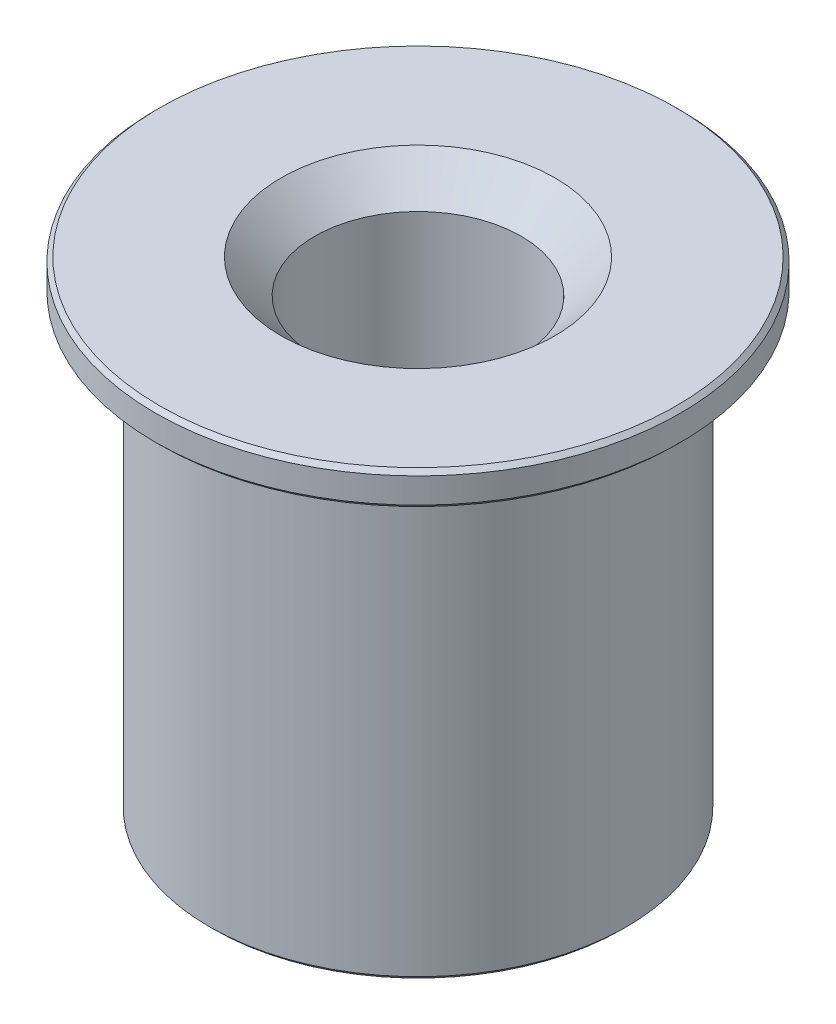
from build123d import *

# Parameters (mm, degrees)
SKETCH1_R      = 6.2865
SKETCH1_R_2    = 3.1115
EXTRUDE1_DEPTH = 14.478
EXTRUDE2_START = -1.016
SKETCH2_R      = 7.9121
SKETCH2_R_2    = 3.1115
EXTRUDE2_DEPTH = 1.016
CHAMFER1_SIZE  = 1.016
CHAMFER2_SIZE  = 0.127


with BuildPart() as part:
    # Sketch1 → Extrude1 (new body)
    with BuildSketch(Plane(origin=(0, 0, 0), x_dir=(1, 0, 0), z_dir=(0, 1, 0))):
        with Locations(Location((0, 0, 0), (0, 0, 270))):
            Circle(SKETCH1_R)
        with Locations(Location((0, 0, 0), (0, 0, 270))):
            Circle(SKETCH1_R_2, mode=Mode.SUBTRACT)
    extrude(amount=EXTRUDE1_DEPTH)

    # Sketch2 → Extrude2 (add)
    with BuildSketch(Plane(origin=(0, 14.478, 0), x_dir=(-1, 0, 0), z_dir=(0, 1, 0)).offset(EXTRUDE2_START)):
        with Locations(Location((0, 0, 0), (0, 0, 90))):
            Circle(SKETCH2_R)
        with Locations(Location((0, 0, 0), (0, 0, 90))):
            Circle(SKETCH2_R_2, mode=Mode.SUBTRACT)
    extrude(amount=EXTRUDE2_DEPTH)

    # Chamfer1
    chamfer1_edges = [part.edges().sort_by_distance(p)[0] for p in [
        (0, 14.478, -3.1115),
    ]]
    chamfer(chamfer1_edges, length=CHAMFER1_SIZE)

    # Chamfer2
    chamfer2_edges = [part.edges().sort_by_distance(p)[0] for p in [
        (0, 14.478, -7.9121),
        (0, 13.462, -7.9121),
        (0, 0, -6.2865),
        (0, 0, -3.1115),
        (0, 13.462, -6.2865),
    ]]
    chamfer(chamfer2_edges, length=CHAMFER2_SIZE)


solid = part.part
